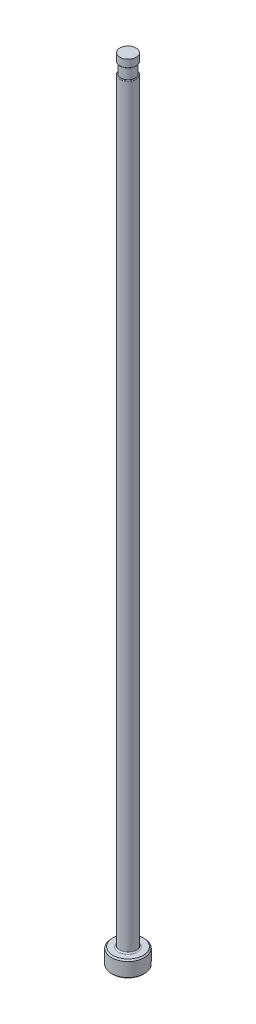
ISO-10303-21;
HEADER;
FILE_DESCRIPTION(('STEP AP214'),'2;1');
FILE_NAME('part.step','',(''),(''),'','','');
FILE_SCHEMA(('AUTOMOTIVE_DESIGN { 1 0 10303 214 1 1 1 1 }'));
ENDSEC;
DATA;
#1=APPLICATION_CONTEXT('core data for automotive mechanical design processes');
#2=APPLICATION_PROTOCOL_DEFINITION('international standard','automotive_design',2000,#1);
#3=PRODUCT_CONTEXT('',#1,'mechanical');
#4=PRODUCT('Part','Part','',(#3));
#5=PRODUCT_RELATED_PRODUCT_CATEGORY('part','',(#4));
#6=PRODUCT_DEFINITION_FORMATION('','',#4);
#7=PRODUCT_DEFINITION_CONTEXT('part definition',#1,'design');
#8=PRODUCT_DEFINITION('design','',#6,#7);
#9=PRODUCT_DEFINITION_SHAPE('','',#8);
#10=(LENGTH_UNIT() NAMED_UNIT(*) SI_UNIT(.MILLI.,.METRE.));
#11=(NAMED_UNIT(*) PLANE_ANGLE_UNIT() SI_UNIT($,.RADIAN.));
#12=(NAMED_UNIT(*) SI_UNIT($,.STERADIAN.) SOLID_ANGLE_UNIT());
#13=UNCERTAINTY_MEASURE_WITH_UNIT(LENGTH_MEASURE(1.E-05),#10,'distance_accuracy_value','');
#14=(GEOMETRIC_REPRESENTATION_CONTEXT(3) GLOBAL_UNCERTAINTY_ASSIGNED_CONTEXT((#13)) GLOBAL_UNIT_ASSIGNED_CONTEXT((#10,
#11,#12)) REPRESENTATION_CONTEXT('',''));
#15=CARTESIAN_POINT('',(0.,0.,0.));
#16=DIRECTION('',(0.,0.,1.));
#17=DIRECTION('',(1.,0.,0.));
#18=AXIS2_PLACEMENT_3D('',#15,#16,#17);
#19=CARTESIAN_POINT('',(-1.58749999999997,150.876,0.));
#20=DIRECTION('',(0.,1.,0.));
#21=DIRECTION('',(0.,0.,1.));
#22=AXIS2_PLACEMENT_3D('',#19,#20,#21);
#23=PLANE('',#22);
#24=CARTESIAN_POINT('',(0.,150.876,0.));
#25=DIRECTION('',(0.,1.,0.));
#26=DIRECTION('',(0.,0.,1.));
#27=AXIS2_PLACEMENT_3D('',#24,#25,#26);
#28=CIRCLE('',#27,1.43509999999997);
#29=CARTESIAN_POINT('',(0.,150.876,1.43509999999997));
#30=VERTEX_POINT('',#29);
#31=EDGE_CURVE('E11',#30,#30,#28,.F.);
#32=ORIENTED_EDGE('',*,*,#31,.T.);
#33=EDGE_LOOP('',(#32));
#34=FACE_BOUND('',#33,.T.);
#35=CARTESIAN_POINT('',(0.,150.876,0.));
#36=DIRECTION('',(0.,1.,0.));
#37=DIRECTION('',(0.,0.,1.));
#38=AXIS2_PLACEMENT_3D('',#35,#36,#37);
#39=CIRCLE('',#38,1.38429999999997);
#40=CARTESIAN_POINT('',(0.,150.876,1.38429999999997));
#41=VERTEX_POINT('',#40);
#42=EDGE_CURVE('E78',#41,#41,#39,.T.);
#43=ORIENTED_EDGE('',*,*,#42,.T.);
#44=EDGE_LOOP('',(#43));
#45=FACE_BOUND('',#44,.T.);
#46=ADVANCED_FACE('F36',(#34,#45),#23,.F.);
#47=CARTESIAN_POINT('',(0.,259.958771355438,0.));
#48=DIRECTION('',(0.,1.,0.));
#49=DIRECTION('',(0.,0.,1.));
#50=AXIS2_PLACEMENT_3D('',#47,#48,#49);
#51=CYLINDRICAL_SURFACE('',#50,1.58749999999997);
#52=DIRECTION('',(0.,1.,0.));
#53=VECTOR('',#52,1.);
#54=CARTESIAN_POINT('',(-1.38429999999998,259.958771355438,-0.777090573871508));
#55=LINE('',#54,#53);
#56=CARTESIAN_POINT('',(-1.38429999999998,148.717,-0.777090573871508));
#57=VERTEX_POINT('',#56);
#58=CARTESIAN_POINT('',(-1.38429999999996,86.36,-0.777090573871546));
#59=VERTEX_POINT('',#58);
#60=EDGE_CURVE('E73',#57,#59,#55,.F.);
#61=ORIENTED_EDGE('',*,*,#60,.F.);
#62=CARTESIAN_POINT('',(0.,148.717,0.));
#63=DIRECTION('',(0.,-1.,0.));
#64=DIRECTION('',(0.,0.,-1.));
#65=AXIS2_PLACEMENT_3D('',#62,#63,#64);
#66=CIRCLE('',#65,1.58749999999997);
#67=CARTESIAN_POINT('',(-1.38429999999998,148.717,0.777090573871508));
#68=VERTEX_POINT('',#67);
#69=EDGE_CURVE('E51',#57,#68,#66,.T.);
#70=ORIENTED_EDGE('',*,*,#69,.T.);
#71=DIRECTION('',(0.,1.,0.));
#72=VECTOR('',#71,1.);
#73=CARTESIAN_POINT('',(-1.38429999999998,259.958771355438,0.777090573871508));
#74=LINE('',#73,#72);
#75=CARTESIAN_POINT('',(-1.38429999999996,86.36,0.777090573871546));
#76=VERTEX_POINT('',#75);
#77=EDGE_CURVE('E84',#76,#68,#74,.T.);
#78=ORIENTED_EDGE('',*,*,#77,.F.);
#79=CARTESIAN_POINT('',(-1.38429999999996,86.36,-0.777090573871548));
#80=CARTESIAN_POINT('',(-1.38429609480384,86.3227272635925,-0.777082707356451));
#81=CARTESIAN_POINT('',(-1.38495631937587,86.2854527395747,-0.775921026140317));
#82=CARTESIAN_POINT('',(-1.38757712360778,86.2110763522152,-0.771232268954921));
#83=CARTESIAN_POINT('',(-1.38953849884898,86.1739746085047,-0.767703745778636));
#84=CARTESIAN_POINT('',(-1.39477495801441,86.0995790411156,-0.758148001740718));
#85=CARTESIAN_POINT('',(-1.39807044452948,86.0622915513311,-0.752081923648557));
#86=CARTESIAN_POINT('',(-1.40590319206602,85.9883849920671,-0.737333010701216));
#87=CARTESIAN_POINT('',(-1.41044024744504,85.9517658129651,-0.728650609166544));
#88=CARTESIAN_POINT('',(-1.42582382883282,85.842986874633,-0.698367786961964));
#89=CARTESIAN_POINT('',(-1.43842338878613,85.7721687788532,-0.672562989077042));
#90=CARTESIAN_POINT('',(-1.46680838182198,85.6376572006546,-0.608160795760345));
#91=CARTESIAN_POINT('',(-1.48256997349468,85.5739156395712,-0.569657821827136));
#92=CARTESIAN_POINT('',(-1.50737283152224,85.4839333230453,-0.498685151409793));
#93=CARTESIAN_POINT('',(-1.51626333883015,85.4536802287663,-0.471232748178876));
#94=CARTESIAN_POINT('',(-1.53347485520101,85.3977865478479,-0.411785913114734));
#95=CARTESIAN_POINT('',(-1.54179640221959,85.3721415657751,-0.379795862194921));
#96=CARTESIAN_POINT('',(-1.55583338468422,85.3303277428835,-0.316871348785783));
#97=CARTESIAN_POINT('',(-1.56175286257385,85.3133042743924,-0.28655344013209));
#98=CARTESIAN_POINT('',(-1.57203785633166,85.28430135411,-0.223329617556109));
#99=CARTESIAN_POINT('',(-1.57640406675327,85.2723196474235,-0.190424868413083));
#100=CARTESIAN_POINT('',(-1.58312350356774,85.254063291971,-0.122641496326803));
#101=CARTESIAN_POINT('',(-1.58546485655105,85.2478222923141,-0.0877524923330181));
#102=CARTESIAN_POINT('',(-1.58779523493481,85.2416097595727,-0.0173445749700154));
#103=CARTESIAN_POINT('',(-1.58778524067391,85.2416356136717,0.0181740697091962));
#104=CARTESIAN_POINT('',(-1.58553927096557,85.2476246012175,0.0850166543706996));
#105=CARTESIAN_POINT('',(-1.58352667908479,85.2529919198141,0.116403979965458));
#106=CARTESIAN_POINT('',(-1.57781194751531,85.2684774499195,0.177812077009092));
#107=CARTESIAN_POINT('',(-1.57410971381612,85.2785959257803,0.20783277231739));
#108=CARTESIAN_POINT('',(-1.56522233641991,85.3034483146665,0.266740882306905));
#109=CARTESIAN_POINT('',(-1.55999564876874,85.3183128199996,0.295566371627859));
#110=CARTESIAN_POINT('',(-1.54854541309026,85.3518843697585,0.350651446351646));
#111=CARTESIAN_POINT('',(-1.54232137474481,85.3705933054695,0.376909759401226));
#112=CARTESIAN_POINT('',(-1.52624085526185,85.4207703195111,0.438380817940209));
#113=CARTESIAN_POINT('',(-1.51605337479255,85.4540994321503,0.471992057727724));
#114=CARTESIAN_POINT('',(-1.49561074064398,85.5258332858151,0.533246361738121));
#115=CARTESIAN_POINT('',(-1.48535548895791,85.5642487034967,0.560876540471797));
#116=CARTESIAN_POINT('',(-1.46194815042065,85.6598127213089,0.61985698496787));
#117=CARTESIAN_POINT('',(-1.44915247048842,85.7185828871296,0.648714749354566));
#118=CARTESIAN_POINT('',(-1.42648713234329,85.8404065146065,0.697138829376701));
#119=CARTESIAN_POINT('',(-1.41662511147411,85.9034706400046,0.716680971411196));
#120=CARTESIAN_POINT('',(-1.40064446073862,86.0318415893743,0.747428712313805));
#121=CARTESIAN_POINT('',(-1.39451475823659,86.0971411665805,0.758658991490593));
#122=CARTESIAN_POINT('',(-1.38838804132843,86.1956223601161,0.769772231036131));
#123=CARTESIAN_POINT('',(-1.38685717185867,86.2284222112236,0.772521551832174));
#124=CARTESIAN_POINT('',(-1.38481284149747,86.2941449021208,0.776178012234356));
#125=CARTESIAN_POINT('',(-1.38429902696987,86.3270676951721,0.777085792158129));
#126=CARTESIAN_POINT('',(-1.38429999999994,86.3599999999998,0.777090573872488));
#127=B_SPLINE_CURVE_WITH_KNOTS('',3,(#79,#80,#81,#82,#83,#84,#85,#86,#87,#88,#89,#90,#91,#92,
#93,#94,#95,#96,#97,#98,#99,#100,#101,#102,#103,#104,#105,#106,#107,#108,#109,#110,#111,#112,
#113,#114,#115,#116,#117,#118,#119,#120,#121,#122,#123,#124,#125,#126),.UNSPECIFIED.,.F.,.F.,(4,
2,2,2,2,2,2,2,2,2,2,2,2,2,2,2,2,2,2,2,2,2,2,4),(0.,0.111796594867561,0.22366161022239,
0.33730621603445,0.450932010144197,0.678971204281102,0.905351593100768,1.03037322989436,
1.1552749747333,1.26065408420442,1.36598601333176,1.47193148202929,1.57783277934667,
1.67311136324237,1.76839524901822,1.86656705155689,1.96478726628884,2.10923104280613,
2.25398297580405,2.45303424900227,2.65259927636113,2.85156933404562,2.95036438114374,
3.04912507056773),.UNSPECIFIED.);
#128=EDGE_CURVE('E81',#59,#76,#127,.T.);
#129=ORIENTED_EDGE('',*,*,#128,.F.);
#130=EDGE_LOOP('',(#61,#70,#78,#129));
#131=FACE_BOUND('',#130,.T.);
#132=CARTESIAN_POINT('',(0.,3.42900000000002,0.));
#133=DIRECTION('',(0.,1.,0.));
#134=DIRECTION('',(0.,0.,1.));
#135=AXIS2_PLACEMENT_3D('',#132,#133,#134);
#136=CIRCLE('',#135,1.58749999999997);
#137=CARTESIAN_POINT('',(0.,3.42900000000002,1.58749999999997));
#138=VERTEX_POINT('',#137);
#139=EDGE_CURVE('E116',#138,#138,#136,.T.);
#140=ORIENTED_EDGE('',*,*,#139,.T.);
#141=EDGE_LOOP('',(#140));
#142=FACE_BOUND('',#141,.T.);
#143=ADVANCED_FACE('F82',(#131,#142),#51,.T.);
#144=CARTESIAN_POINT('',(0.,0.,0.));
#145=DIRECTION('',(0.,-1.,0.));
#146=DIRECTION('',(0.,0.,-1.));
#147=AXIS2_PLACEMENT_3D('',#144,#145,#146);
#148=PLANE('',#147);
#149=CARTESIAN_POINT('',(0.,0.,0.));
#150=DIRECTION('',(0.,-1.,0.));
#151=DIRECTION('',(0.,0.,-1.));
#152=AXIS2_PLACEMENT_3D('',#149,#150,#151);
#153=CIRCLE('',#152,2.92099999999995);
#154=CARTESIAN_POINT('',(0.,0.,-2.92099999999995));
#155=VERTEX_POINT('',#154);
#156=EDGE_CURVE('E113',#155,#155,#153,.T.);
#157=ORIENTED_EDGE('',*,*,#156,.T.);
#158=EDGE_LOOP('',(#157));
#159=FACE_BOUND('',#158,.T.);
#160=ADVANCED_FACE('F192',(#159),#148,.T.);
#161=CARTESIAN_POINT('',(0.,259.958771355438,0.));
#162=DIRECTION('',(0.,1.,0.));
#163=DIRECTION('',(0.,0.,1.));
#164=AXIS2_PLACEMENT_3D('',#161,#162,#163);
#165=CYLINDRICAL_SURFACE('',#164,3.17499999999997);
#166=CARTESIAN_POINT('',(0.,2.92100000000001,0.));
#167=DIRECTION('',(0.,1.,0.));
#168=DIRECTION('',(0.,0.,1.));
#169=AXIS2_PLACEMENT_3D('',#166,#167,#168);
#170=CIRCLE('',#169,3.17499999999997);
#171=CARTESIAN_POINT('',(0.,2.92100000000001,3.17499999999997));
#172=VERTEX_POINT('',#171);
#173=EDGE_CURVE('E110',#172,#172,#170,.F.);
#174=ORIENTED_EDGE('',*,*,#173,.T.);
#175=EDGE_LOOP('',(#174));
#176=FACE_BOUND('',#175,.T.);
#177=CARTESIAN_POINT('',(0.,0.254000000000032,0.));
#178=DIRECTION('',(0.,-1.,0.));
#179=DIRECTION('',(0.,0.,-1.));
#180=AXIS2_PLACEMENT_3D('',#177,#178,#179);
#181=CIRCLE('',#180,3.17499999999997);
#182=CARTESIAN_POINT('',(0.,0.254000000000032,-3.17499999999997));
#183=VERTEX_POINT('',#182);
#184=EDGE_CURVE('E107',#183,#183,#181,.F.);
#185=ORIENTED_EDGE('',*,*,#184,.T.);
#186=EDGE_LOOP('',(#185));
#187=FACE_BOUND('',#186,.T.);
#188=ADVANCED_FACE('F195',(#176,#187),#165,.T.);
#189=CARTESIAN_POINT('',(-3.17499999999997,3.175,0.));
#190=DIRECTION('',(0.,1.,0.));
#191=DIRECTION('',(0.,0.,1.));
#192=AXIS2_PLACEMENT_3D('',#189,#190,#191);
#193=PLANE('',#192);
#194=CARTESIAN_POINT('',(0.,3.175,0.));
#195=DIRECTION('',(0.,1.,0.));
#196=DIRECTION('',(0.,0.,1.));
#197=AXIS2_PLACEMENT_3D('',#194,#195,#196);
#198=CIRCLE('',#197,1.84149999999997);
#199=CARTESIAN_POINT('',(0.,3.175,1.84149999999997));
#200=VERTEX_POINT('',#199);
#201=EDGE_CURVE('E87',#200,#200,#198,.F.);
#202=ORIENTED_EDGE('',*,*,#201,.T.);
#203=EDGE_LOOP('',(#202));
#204=FACE_BOUND('',#203,.T.);
#205=CARTESIAN_POINT('',(0.,3.175,0.));
#206=DIRECTION('',(0.,1.,0.));
#207=DIRECTION('',(0.,0.,1.));
#208=AXIS2_PLACEMENT_3D('',#205,#206,#207);
#209=CIRCLE('',#208,2.92099999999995);
#210=CARTESIAN_POINT('',(0.,3.175,2.92099999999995));
#211=VERTEX_POINT('',#210);
#212=EDGE_CURVE('E104',#211,#211,#209,.T.);
#213=ORIENTED_EDGE('',*,*,#212,.T.);
#214=EDGE_LOOP('',(#213));
#215=FACE_BOUND('',#214,.T.);
#216=ADVANCED_FACE('F190',(#204,#215),#193,.T.);
#217=CARTESIAN_POINT('',(0.,3.17499999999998,0.));
#218=DIRECTION('',(0.,-1.,0.));
#219=DIRECTION('',(0.,0.,-1.));
#220=AXIS2_PLACEMENT_3D('',#217,#218,#219);
#221=CONICAL_SURFACE('',#220,2.92099999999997,0.7853981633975);
#222=ORIENTED_EDGE('',*,*,#173,.F.);
#223=EDGE_LOOP('',(#222));
#224=FACE_BOUND('',#223,.T.);
#225=ORIENTED_EDGE('',*,*,#212,.F.);
#226=EDGE_LOOP('',(#225));
#227=FACE_BOUND('',#226,.T.);
#228=ADVANCED_FACE('F186',(#224,#227),#221,.T.);
#229=CARTESIAN_POINT('',(0.,0.254000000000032,0.));
#230=DIRECTION('',(0.,1.,0.));
#231=DIRECTION('',(0.,0.,1.));
#232=AXIS2_PLACEMENT_3D('',#229,#230,#231);
#233=CONICAL_SURFACE('',#232,3.17499999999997,0.785398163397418);
#234=ORIENTED_EDGE('',*,*,#156,.F.);
#235=EDGE_LOOP('',(#234));
#236=FACE_BOUND('',#235,.T.);
#237=ORIENTED_EDGE('',*,*,#184,.F.);
#238=EDGE_LOOP('',(#237));
#239=FACE_BOUND('',#238,.T.);
#240=ADVANCED_FACE('F182',(#236,#239),#233,.T.);
#241=CARTESIAN_POINT('',(0.,3.42900000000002,0.));
#242=DIRECTION('',(0.,1.,0.));
#243=DIRECTION('',(0.,0.,1.));
#244=AXIS2_PLACEMENT_3D('',#241,#242,#243);
#245=TOROIDAL_SURFACE('',#244,1.84149999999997,0.254);
#246=ORIENTED_EDGE('',*,*,#201,.F.);
#247=EDGE_LOOP('',(#246));
#248=FACE_BOUND('',#247,.T.);
#249=ORIENTED_EDGE('',*,*,#139,.F.);
#250=EDGE_LOOP('',(#249));
#251=FACE_BOUND('',#250,.T.);
#252=ADVANCED_FACE('F147',(#248,#251),#245,.F.);
#253=CARTESIAN_POINT('',(-1.58749999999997,148.844,0.));
#254=DIRECTION('',(0.,-1.,0.));
#255=DIRECTION('',(0.,0.,-1.));
#256=AXIS2_PLACEMENT_3D('',#253,#254,#255);
#257=PLANE('',#256);
#258=DIRECTION('',(0.,0.,1.));
#259=VECTOR('',#258,1.);
#260=CARTESIAN_POINT('',(-1.38429999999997,148.844,0.));
#261=LINE('',#260,#259);
#262=CARTESIAN_POINT('',(-1.38429999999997,148.844,0.));
#263=VERTEX_POINT('',#262);
#264=CARTESIAN_POINT('',(-1.38429999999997,148.844,0.465589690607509));
#265=VERTEX_POINT('',#264);
#266=EDGE_CURVE('E90',#263,#265,#261,.T.);
#267=ORIENTED_EDGE('',*,*,#266,.T.);
#268=CARTESIAN_POINT('',(0.,148.844,0.));
#269=DIRECTION('',(0.,-1.,0.));
#270=DIRECTION('',(0.,0.,-1.));
#271=AXIS2_PLACEMENT_3D('',#268,#269,#270);
#272=CIRCLE('',#271,1.46049999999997);
#273=CARTESIAN_POINT('',(-1.38429999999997,148.844,-0.465589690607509));
#274=VERTEX_POINT('',#273);
#275=EDGE_CURVE('E86',#265,#274,#272,.F.);
#276=ORIENTED_EDGE('',*,*,#275,.T.);
#277=EDGE_CURVE('E79',#274,#263,#261,.T.);
#278=ORIENTED_EDGE('',*,*,#277,.T.);
#279=CARTESIAN_POINT('',(0.,148.844,0.));
#280=DIRECTION('',(0.,1.,0.));
#281=DIRECTION('',(0.,0.,1.));
#282=AXIS2_PLACEMENT_3D('',#279,#280,#281);
#283=CIRCLE('',#282,1.38429999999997);
#284=EDGE_CURVE('E101',#263,#263,#283,.T.);
#285=ORIENTED_EDGE('',*,*,#284,.F.);
#286=EDGE_LOOP('',(#267,#276,#278,#285));
#287=FACE_BOUND('',#286,.T.);
#288=ADVANCED_FACE('F144',(#287),#257,.F.);
#289=CARTESIAN_POINT('',(0.,153.448281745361,0.));
#290=DIRECTION('',(0.,1.,0.));
#291=DIRECTION('',(0.,0.,1.));
#292=AXIS2_PLACEMENT_3D('',#289,#290,#291);
#293=CYLINDRICAL_SURFACE('',#292,1.38429999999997);
#294=ORIENTED_EDGE('',*,*,#42,.F.);
#295=EDGE_LOOP('',(#294));
#296=FACE_BOUND('',#295,.T.);
#297=ORIENTED_EDGE('',*,*,#284,.T.);
#298=EDGE_LOOP('',(#297));
#299=FACE_BOUND('',#298,.T.);
#300=ADVANCED_FACE('F141',(#296,#299),#293,.T.);
#301=CARTESIAN_POINT('',(-1.38429999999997,149.86,-3.17499999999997));
#302=DIRECTION('',(1.,0.,0.));
#303=DIRECTION('',(0.,1.,0.));
#304=AXIS2_PLACEMENT_3D('',#301,#302,#303);
#305=PLANE('',#304);
#306=ORIENTED_EDGE('',*,*,#277,.F.);
#307=CARTESIAN_POINT('',(-1.38429999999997,148.844,-0.465589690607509));
#308=CARTESIAN_POINT('',(-1.38429999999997,148.843994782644,-0.479559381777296));
#309=CARTESIAN_POINT('',(-1.38429999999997,148.843765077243,-0.493535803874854));
#310=CARTESIAN_POINT('',(-1.38429999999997,148.842708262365,-0.521508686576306));
#311=CARTESIAN_POINT('',(-1.38429999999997,148.841879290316,-0.535505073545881));
#312=CARTESIAN_POINT('',(-1.38429999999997,148.839476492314,-0.563404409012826));
#313=CARTESIAN_POINT('',(-1.38429999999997,148.837904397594,-0.577307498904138));
#314=CARTESIAN_POINT('',(-1.38429999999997,148.833817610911,-0.604962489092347));
#315=CARTESIAN_POINT('',(-1.38429999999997,148.831304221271,-0.618714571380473));
#316=CARTESIAN_POINT('',(-1.38429999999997,148.826078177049,-0.641494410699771));
#317=CARTESIAN_POINT('',(-1.38429999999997,148.823698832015,-0.650597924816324));
#318=CARTESIAN_POINT('',(-1.38429999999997,148.818254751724,-0.668645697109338));
#319=CARTESIAN_POINT('',(-1.38429999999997,148.815187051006,-0.677589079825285));
#320=CARTESIAN_POINT('',(-1.38429999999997,148.807185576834,-0.697758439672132));
#321=CARTESIAN_POINT('',(-1.38429999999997,148.801968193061,-0.708874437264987));
#322=CARTESIAN_POINT('',(-1.38429999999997,148.78965165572,-0.7300023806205));
#323=CARTESIAN_POINT('',(-1.38429999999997,148.782567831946,-0.740022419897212));
#324=CARTESIAN_POINT('',(-1.38429999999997,148.77108447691,-0.752196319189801));
#325=CARTESIAN_POINT('',(-1.38429999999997,148.767763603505,-0.75536058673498));
#326=CARTESIAN_POINT('',(-1.38429999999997,148.760727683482,-0.761230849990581));
#327=CARTESIAN_POINT('',(-1.38429999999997,148.757012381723,-0.763936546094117));
#328=CARTESIAN_POINT('',(-1.38429999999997,148.749139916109,-0.768755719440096));
#329=CARTESIAN_POINT('',(-1.38429999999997,148.744977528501,-0.770860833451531));
#330=CARTESIAN_POINT('',(-1.38429999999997,148.736327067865,-0.774221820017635));
#331=CARTESIAN_POINT('',(-1.38429999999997,148.731840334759,-0.775480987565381));
#332=CARTESIAN_POINT('',(-1.38429999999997,148.72557988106,-0.77652141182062));
#333=CARTESIAN_POINT('',(-1.38429999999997,148.723871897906,-0.776734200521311));
#334=CARTESIAN_POINT('',(-1.38429999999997,148.720442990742,-0.777018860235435));
#335=CARTESIAN_POINT('',(-1.38429999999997,148.718722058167,-0.77709062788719));
#336=CARTESIAN_POINT('',(-1.38429999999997,148.717,-0.777090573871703));
#337=B_SPLINE_CURVE_WITH_KNOTS('',3,(#307,#308,#309,#310,#311,#312,#313,#314,#315,#316,#317,
#318,#319,#320,#321,#322,#323,#324,#325,#326,#327,#328,#329,#330,#331,#332,#333,#334,#335,#336),
.UNSPECIFIED.,.F.,.F.,(4,2,2,2,2,2,2,2,2,2,2,2,2,2,4),(0.,0.0419176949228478,0.0839662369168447,
0.125917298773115,0.167810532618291,0.196018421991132,0.224350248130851,0.261087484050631,
0.29753191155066,0.311262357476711,0.325001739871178,0.338924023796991,0.352791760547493,
0.357950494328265,0.363113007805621),.UNSPECIFIED.);
#338=EDGE_CURVE('E59',#274,#57,#337,.T.);
#339=ORIENTED_EDGE('',*,*,#338,.T.);
#340=ORIENTED_EDGE('',*,*,#60,.T.);
#341=DIRECTION('',(0.,0.,1.));
#342=VECTOR('',#341,1.);
#343=CARTESIAN_POINT('',(-1.38429999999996,86.36,-3.17499999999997));
#344=LINE('',#343,#342);
#345=EDGE_CURVE('E77',#59,#76,#344,.T.);
#346=ORIENTED_EDGE('',*,*,#345,.T.);
#347=ORIENTED_EDGE('',*,*,#77,.T.);
#348=CARTESIAN_POINT('',(-1.38429999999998,148.717,0.777090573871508));
#349=CARTESIAN_POINT('',(-1.38429999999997,148.720750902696,0.777099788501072));
#350=CARTESIAN_POINT('',(-1.38429999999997,148.7244915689,0.776751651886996));
#351=CARTESIAN_POINT('',(-1.38429999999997,148.731825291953,0.775421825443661));
#352=CARTESIAN_POINT('',(-1.38429999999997,148.735419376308,0.77444588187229));
#353=CARTESIAN_POINT('',(-1.38429999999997,148.742393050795,0.771942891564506));
#354=CARTESIAN_POINT('',(-1.38429999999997,148.745773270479,0.770417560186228));
#355=CARTESIAN_POINT('',(-1.38429999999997,148.752296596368,0.766915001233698));
#356=CARTESIAN_POINT('',(-1.38429999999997,148.75543911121,0.764936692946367));
#357=CARTESIAN_POINT('',(-1.38429999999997,148.763606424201,0.759093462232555));
#358=CARTESIAN_POINT('',(-1.38429999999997,148.768385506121,0.754885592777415));
#359=CARTESIAN_POINT('',(-1.38429999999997,148.777244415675,0.745791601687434));
#360=CARTESIAN_POINT('',(-1.38429999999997,148.781322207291,0.740903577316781));
#361=CARTESIAN_POINT('',(-1.38429999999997,148.791805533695,0.726719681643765));
#362=CARTESIAN_POINT('',(-1.38429999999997,148.797560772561,0.71694762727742));
#363=CARTESIAN_POINT('',(-1.38429999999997,148.807646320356,0.696707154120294));
#364=CARTESIAN_POINT('',(-1.38429999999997,148.811972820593,0.686236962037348));
#365=CARTESIAN_POINT('',(-1.38429999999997,148.820704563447,0.661619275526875));
#366=CARTESIAN_POINT('',(-1.38429999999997,148.824720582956,0.647335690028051));
#367=CARTESIAN_POINT('',(-1.38429999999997,148.831382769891,0.618445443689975));
#368=CARTESIAN_POINT('',(-1.38429999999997,148.83402632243,0.603838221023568));
#369=CARTESIAN_POINT('',(-1.38429999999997,148.840406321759,0.559733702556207));
#370=CARTESIAN_POINT('',(-1.38429999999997,148.842575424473,0.530010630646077));
#371=CARTESIAN_POINT('',(-1.38429999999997,148.843661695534,0.494502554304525));
#372=CARTESIAN_POINT('',(-1.38429999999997,148.843791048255,0.488707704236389));
#373=CARTESIAN_POINT('',(-1.38429999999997,148.843960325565,0.477139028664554));
#374=CARTESIAN_POINT('',(-1.38429999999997,148.844000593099,0.471365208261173));
#375=CARTESIAN_POINT('',(-1.38429999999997,148.844,0.465589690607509));
#376=B_SPLINE_CURVE_WITH_KNOTS('',3,(#348,#349,#350,#351,#352,#353,#354,#355,#356,#357,#358,
#359,#360,#361,#362,#363,#364,#365,#366,#367,#368,#369,#370,#371,#372,#373,#374,#375),
.UNSPECIFIED.,.F.,.F.,(4,2,2,2,2,2,2,2,2,2,2,2,2,4),(0.,0.0112203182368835,0.0223393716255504,
0.0334240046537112,0.0445353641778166,0.0635271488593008,0.0825731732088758,0.116404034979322,
0.150324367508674,0.194732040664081,0.239224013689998,0.328384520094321,0.345774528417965,
0.36309747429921),.UNSPECIFIED.);
#377=EDGE_CURVE('E172',#68,#265,#376,.T.);
#378=ORIENTED_EDGE('',*,*,#377,.T.);
#379=ORIENTED_EDGE('',*,*,#266,.F.);
#380=EDGE_LOOP('',(#306,#339,#340,#346,#347,#378,#379));
#381=FACE_BOUND('',#380,.T.);
#382=ADVANCED_FACE('F75',(#381),#305,.F.);
#383=CARTESIAN_POINT('',(-4.55929999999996,86.36,-3.17499999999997));
#384=DIRECTION('',(0.,0.,1.));
#385=DIRECTION('',(1.,0.,0.));
#386=AXIS2_PLACEMENT_3D('',#383,#384,#385);
#387=CYLINDRICAL_SURFACE('',#386,3.175);
#388=ORIENTED_EDGE('',*,*,#345,.F.);
#389=ORIENTED_EDGE('',*,*,#128,.T.);
#390=EDGE_LOOP('',(#388,#389));
#391=FACE_BOUND('',#390,.T.);
#392=ADVANCED_FACE('F89',(#391),#387,.F.);
#393=CARTESIAN_POINT('',(0.,152.687735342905,0.));
#394=DIRECTION('',(0.,1.,0.));
#395=DIRECTION('',(0.,0.,1.));
#396=AXIS2_PLACEMENT_3D('',#393,#394,#395);
#397=CYLINDRICAL_SURFACE('',#396,1.56209999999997);
#398=CARTESIAN_POINT('',(0.,151.003,0.));
#399=DIRECTION('',(0.,1.,0.));
#400=DIRECTION('',(0.,0.,1.));
#401=AXIS2_PLACEMENT_3D('',#398,#399,#400);
#402=CIRCLE('',#401,1.56209999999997);
#403=CARTESIAN_POINT('',(0.,151.003,1.56209999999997));
#404=VERTEX_POINT('',#403);
#405=EDGE_CURVE('E44',#404,#404,#402,.T.);
#406=ORIENTED_EDGE('',*,*,#405,.T.);
#407=EDGE_LOOP('',(#406));
#408=FACE_BOUND('',#407,.T.);
#409=CARTESIAN_POINT('',(0.,152.4,0.));
#410=DIRECTION('',(0.,1.,0.));
#411=DIRECTION('',(0.,0.,1.));
#412=AXIS2_PLACEMENT_3D('',#409,#410,#411);
#413=CIRCLE('',#412,1.56209999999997);
#414=CARTESIAN_POINT('',(0.,152.4,1.56209999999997));
#415=VERTEX_POINT('',#414);
#416=EDGE_CURVE('E91',#415,#415,#413,.T.);
#417=ORIENTED_EDGE('',*,*,#416,.F.);
#418=EDGE_LOOP('',(#417));
#419=FACE_BOUND('',#418,.T.);
#420=ADVANCED_FACE('F135',(#408,#419),#397,.T.);
#421=CARTESIAN_POINT('',(-1.58749999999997,152.4,0.));
#422=DIRECTION('',(0.,1.,0.));
#423=DIRECTION('',(0.,0.,1.));
#424=AXIS2_PLACEMENT_3D('',#421,#422,#423);
#425=PLANE('',#424);
#426=ORIENTED_EDGE('',*,*,#416,.T.);
#427=EDGE_LOOP('',(#426));
#428=FACE_BOUND('',#427,.T.);
#429=ADVANCED_FACE('F149',(#428),#425,.T.);
#430=CARTESIAN_POINT('',(0.,148.717,0.));
#431=DIRECTION('',(0.,-1.,0.));
#432=DIRECTION('',(0.,0.,-1.));
#433=AXIS2_PLACEMENT_3D('',#430,#431,#432);
#434=TOROIDAL_SURFACE('',#433,1.46049999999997,0.127);
#435=ORIENTED_EDGE('',*,*,#377,.F.);
#436=ORIENTED_EDGE('',*,*,#69,.F.);
#437=ORIENTED_EDGE('',*,*,#338,.F.);
#438=ORIENTED_EDGE('',*,*,#275,.F.);
#439=EDGE_LOOP('',(#435,#436,#437,#438));
#440=FACE_BOUND('',#439,.T.);
#441=ADVANCED_FACE('F151',(#440),#434,.T.);
#442=CARTESIAN_POINT('',(0.,151.003,0.));
#443=DIRECTION('',(0.,1.,0.));
#444=DIRECTION('',(0.,0.,1.));
#445=AXIS2_PLACEMENT_3D('',#442,#443,#444);
#446=TOROIDAL_SURFACE('',#445,1.43509999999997,0.127);
#447=ORIENTED_EDGE('',*,*,#31,.F.);
#448=EDGE_LOOP('',(#447));
#449=FACE_BOUND('',#448,.T.);
#450=ORIENTED_EDGE('',*,*,#405,.F.);
#451=EDGE_LOOP('',(#450));
#452=FACE_BOUND('',#451,.T.);
#453=ADVANCED_FACE('F38',(#449,#452),#446,.T.);
#454=CLOSED_SHELL('',(#46,#143,#160,#188,#216,#228,#240,#252,#288,#300,#382,#392,#420,#429,#441,#453));
#455=MANIFOLD_SOLID_BREP('B2',#454);
#456=ADVANCED_BREP_SHAPE_REPRESENTATION('',(#18,#455),#14);
#457=SHAPE_DEFINITION_REPRESENTATION(#9,#456);
ENDSEC;
END-ISO-10303-21;
